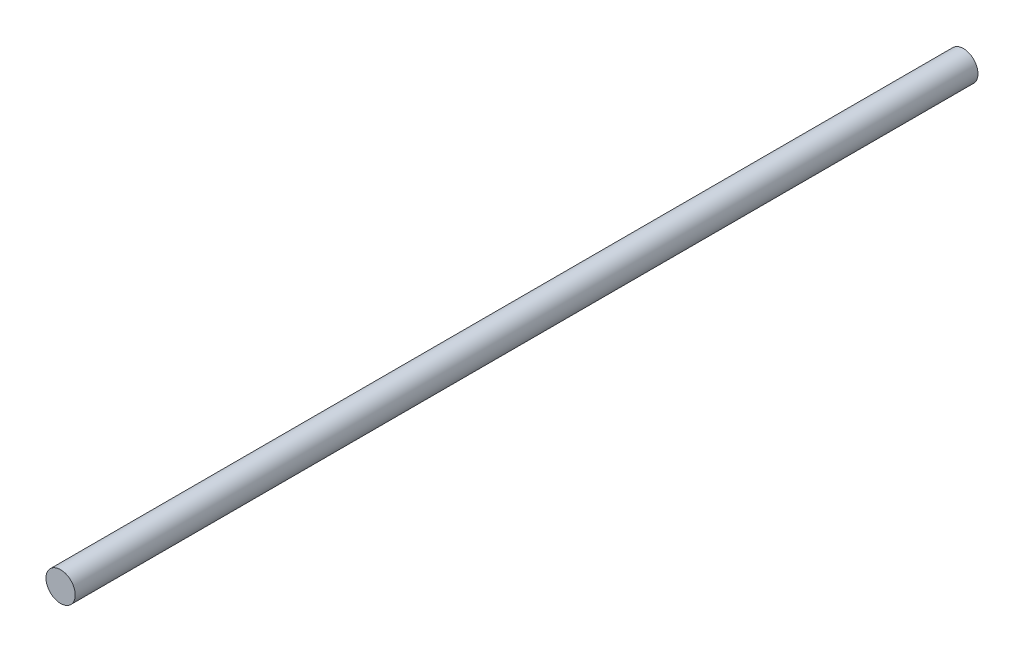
ISO-10303-21;
HEADER;
FILE_DESCRIPTION(('STEP AP214'),'2;1');
FILE_NAME('part.step','',(''),(''),'','','');
FILE_SCHEMA(('AUTOMOTIVE_DESIGN { 1 0 10303 214 1 1 1 1 }'));
ENDSEC;
DATA;
#1=APPLICATION_CONTEXT('core data for automotive mechanical design processes');
#2=APPLICATION_PROTOCOL_DEFINITION('international standard','automotive_design',2000,#1);
#3=PRODUCT_CONTEXT('',#1,'mechanical');
#4=PRODUCT('Part','Part','',(#3));
#5=PRODUCT_RELATED_PRODUCT_CATEGORY('part','',(#4));
#6=PRODUCT_DEFINITION_FORMATION('','',#4);
#7=PRODUCT_DEFINITION_CONTEXT('part definition',#1,'design');
#8=PRODUCT_DEFINITION('design','',#6,#7);
#9=PRODUCT_DEFINITION_SHAPE('','',#8);
#10=(LENGTH_UNIT() NAMED_UNIT(*) SI_UNIT(.MILLI.,.METRE.));
#11=(NAMED_UNIT(*) PLANE_ANGLE_UNIT() SI_UNIT($,.RADIAN.));
#12=(NAMED_UNIT(*) SI_UNIT($,.STERADIAN.) SOLID_ANGLE_UNIT());
#13=UNCERTAINTY_MEASURE_WITH_UNIT(LENGTH_MEASURE(1.E-05),#10,'distance_accuracy_value','');
#14=(GEOMETRIC_REPRESENTATION_CONTEXT(3) GLOBAL_UNCERTAINTY_ASSIGNED_CONTEXT((#13)) GLOBAL_UNIT_ASSIGNED_CONTEXT((#10,
#11,#12)) REPRESENTATION_CONTEXT('',''));
#15=CARTESIAN_POINT('',(0.,0.,0.));
#16=DIRECTION('',(0.,0.,1.));
#17=DIRECTION('',(1.,0.,0.));
#18=AXIS2_PLACEMENT_3D('',#15,#16,#17);
#19=CARTESIAN_POINT('',(0.,0.,-1850.));
#20=DIRECTION('',(0.,0.,1.));
#21=DIRECTION('',(1.,0.,0.));
#22=AXIS2_PLACEMENT_3D('',#19,#20,#21);
#23=CYLINDRICAL_SURFACE('',#22,30.);
#24=CARTESIAN_POINT('',(0.,0.,-1850.));
#25=DIRECTION('',(0.,0.,1.));
#26=DIRECTION('',(1.,0.,0.));
#27=AXIS2_PLACEMENT_3D('',#24,#25,#26);
#28=CIRCLE('',#27,30.);
#29=CARTESIAN_POINT('',(30.,0.,-1850.));
#30=VERTEX_POINT('',#29);
#31=EDGE_CURVE('E10',#30,#30,#28,.T.);
#32=CARTESIAN_POINT('',(0.,0.,0.));
#33=DIRECTION('',(0.,0.,1.));
#34=DIRECTION('',(1.,0.,0.));
#35=AXIS2_PLACEMENT_3D('',#32,#33,#34);
#36=CIRCLE('',#35,30.);
#37=CARTESIAN_POINT('',(30.,0.,-2.22044604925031E-13));
#38=VERTEX_POINT('',#37);
#39=EDGE_CURVE('E40',#38,#38,#36,.T.);
#40=CARTESIAN_POINT('',(30.,0.,-1850.));
#41=CARTESIAN_POINT('',(30.,0.,-1830.72916666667));
#42=CARTESIAN_POINT('',(30.,0.,-1811.45833333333));
#43=CARTESIAN_POINT('',(30.,0.,-1772.91666666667));
#44=CARTESIAN_POINT('',(30.,0.,-1753.64583333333));
#45=CARTESIAN_POINT('',(30.,0.,-1715.10416666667));
#46=CARTESIAN_POINT('',(30.,0.,-1695.83333333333));
#47=CARTESIAN_POINT('',(30.,0.,-1657.29166666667));
#48=CARTESIAN_POINT('',(30.,0.,-1638.02083333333));
#49=CARTESIAN_POINT('',(30.,0.,-1599.47916666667));
#50=CARTESIAN_POINT('',(30.,0.,-1580.20833333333));
#51=CARTESIAN_POINT('',(30.,0.,-1541.66666666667));
#52=CARTESIAN_POINT('',(30.,0.,-1522.39583333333));
#53=CARTESIAN_POINT('',(30.,0.,-1483.85416666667));
#54=CARTESIAN_POINT('',(30.,0.,-1464.58333333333));
#55=CARTESIAN_POINT('',(30.,0.,-1426.04166666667));
#56=CARTESIAN_POINT('',(30.,0.,-1406.77083333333));
#57=CARTESIAN_POINT('',(30.,0.,-1368.22916666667));
#58=CARTESIAN_POINT('',(30.,0.,-1348.95833333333));
#59=CARTESIAN_POINT('',(30.,0.,-1310.41666666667));
#60=CARTESIAN_POINT('',(30.,0.,-1291.14583333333));
#61=CARTESIAN_POINT('',(30.,0.,-1252.60416666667));
#62=CARTESIAN_POINT('',(30.,0.,-1233.33333333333));
#63=CARTESIAN_POINT('',(30.,0.,-1194.79166666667));
#64=CARTESIAN_POINT('',(30.,0.,-1175.52083333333));
#65=CARTESIAN_POINT('',(30.,0.,-1136.97916666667));
#66=CARTESIAN_POINT('',(30.,0.,-1117.70833333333));
#67=CARTESIAN_POINT('',(30.,0.,-1079.16666666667));
#68=CARTESIAN_POINT('',(30.,0.,-1059.89583333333));
#69=CARTESIAN_POINT('',(30.,0.,-1021.35416666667));
#70=CARTESIAN_POINT('',(30.,0.,-1002.08333333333));
#71=CARTESIAN_POINT('',(30.,0.,-963.541666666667));
#72=CARTESIAN_POINT('',(30.,0.,-944.270833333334));
#73=CARTESIAN_POINT('',(30.,0.,-905.729166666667));
#74=CARTESIAN_POINT('',(30.,0.,-886.458333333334));
#75=CARTESIAN_POINT('',(30.,0.,-847.916666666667));
#76=CARTESIAN_POINT('',(30.,0.,-828.645833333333));
#77=CARTESIAN_POINT('',(30.,0.,-790.104166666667));
#78=CARTESIAN_POINT('',(30.,0.,-770.833333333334));
#79=CARTESIAN_POINT('',(30.,0.,-732.291666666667));
#80=CARTESIAN_POINT('',(30.,0.,-713.020833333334));
#81=CARTESIAN_POINT('',(30.,0.,-674.479166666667));
#82=CARTESIAN_POINT('',(30.,0.,-655.208333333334));
#83=CARTESIAN_POINT('',(30.,0.,-616.666666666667));
#84=CARTESIAN_POINT('',(30.,0.,-597.395833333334));
#85=CARTESIAN_POINT('',(30.,0.,-558.854166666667));
#86=CARTESIAN_POINT('',(30.,0.,-539.583333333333));
#87=CARTESIAN_POINT('',(30.,0.,-501.041666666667));
#88=CARTESIAN_POINT('',(30.,0.,-481.770833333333));
#89=CARTESIAN_POINT('',(30.,0.,-443.229166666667));
#90=CARTESIAN_POINT('',(30.,0.,-423.958333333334));
#91=CARTESIAN_POINT('',(30.,0.,-385.416666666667));
#92=CARTESIAN_POINT('',(30.,0.,-366.145833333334));
#93=CARTESIAN_POINT('',(30.,0.,-327.604166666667));
#94=CARTESIAN_POINT('',(30.,0.,-308.333333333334));
#95=CARTESIAN_POINT('',(30.,0.,-269.791666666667));
#96=CARTESIAN_POINT('',(30.,0.,-250.520833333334));
#97=CARTESIAN_POINT('',(30.,0.,-211.979166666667));
#98=CARTESIAN_POINT('',(30.,0.,-192.708333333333));
#99=CARTESIAN_POINT('',(30.,0.,-154.166666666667));
#100=CARTESIAN_POINT('',(30.,0.,-134.895833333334));
#101=CARTESIAN_POINT('',(30.,0.,-96.354166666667));
#102=CARTESIAN_POINT('',(30.,0.,-77.0833333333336));
#103=CARTESIAN_POINT('',(30.,0.,-38.5416666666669));
#104=CARTESIAN_POINT('',(30.,0.,-19.2708333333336));
#105=CARTESIAN_POINT('',(30.,0.,-2.22044604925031E-13));
#106=B_SPLINE_CURVE_WITH_KNOTS('',3,(#40,#41,#42,#43,#44,#45,#46,#47,#48,#49,#50,#51,#52,#53,
#54,#55,#56,#57,#58,#59,#60,#61,#62,#63,#64,#65,#66,#67,#68,#69,#70,#71,#72,#73,#74,#75,#76,#77,
#78,#79,#80,#81,#82,#83,#84,#85,#86,#87,#88,#89,#90,#91,#92,#93,#94,#95,#96,#97,#98,#99,#100,
#101,#102,#103,#104,#105),.UNSPECIFIED.,.F.,.F.,(4,2,2,2,2,2,2,2,2,2,2,2,2,2,2,2,2,2,2,2,2,2,2,
2,2,2,2,2,2,2,2,2,4),(0.,57.8124999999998,115.625,173.4375,231.25,289.0625,346.875,404.6875,
462.5,520.3125,578.125,635.9375,693.75,751.5625,809.375,867.1875,925.,982.8125,1040.625,
1098.4375,1156.25,1214.0625,1271.875,1329.6875,1387.5,1445.3125,1503.125,1560.9375,1618.75,
1676.5625,1734.375,1792.1875,1850.),.UNSPECIFIED.);
#107=EDGE_CURVE('BSEAM37',#30,#38,#106,.T.);
#108=ORIENTED_EDGE('',*,*,#31,.T.);
#109=ORIENTED_EDGE('',*,*,#39,.F.);
#110=ORIENTED_EDGE('',*,*,#107,.T.);
#111=ORIENTED_EDGE('',*,*,#107,.F.);
#112=EDGE_LOOP('',(#108,#110,#109,#111));
#113=FACE_BOUND('',#112,.T.);
#114=ADVANCED_FACE('F37',(#113),#23,.T.);
#115=CARTESIAN_POINT('',(0.,0.,-1850.));
#116=DIRECTION('',(0.,0.,1.));
#117=DIRECTION('',(1.,0.,0.));
#118=AXIS2_PLACEMENT_3D('',#115,#116,#117);
#119=PLANE('',#118);
#120=ORIENTED_EDGE('',*,*,#31,.F.);
#121=EDGE_LOOP('',(#120));
#122=FACE_BOUND('',#121,.T.);
#123=ADVANCED_FACE('F54',(#122),#119,.F.);
#124=CARTESIAN_POINT('',(0.,0.,0.));
#125=DIRECTION('',(0.,0.,1.));
#126=DIRECTION('',(1.,0.,0.));
#127=AXIS2_PLACEMENT_3D('',#124,#125,#126);
#128=PLANE('',#127);
#129=ORIENTED_EDGE('',*,*,#39,.T.);
#130=EDGE_LOOP('',(#129));
#131=FACE_BOUND('',#130,.T.);
#132=ADVANCED_FACE('F51',(#131),#128,.T.);
#133=CLOSED_SHELL('',(#114,#123,#132));
#134=MANIFOLD_SOLID_BREP('B2',#133);
#135=ADVANCED_BREP_SHAPE_REPRESENTATION('',(#18,#134),#14);
#136=SHAPE_DEFINITION_REPRESENTATION(#9,#135);
ENDSEC;
END-ISO-10303-21;
